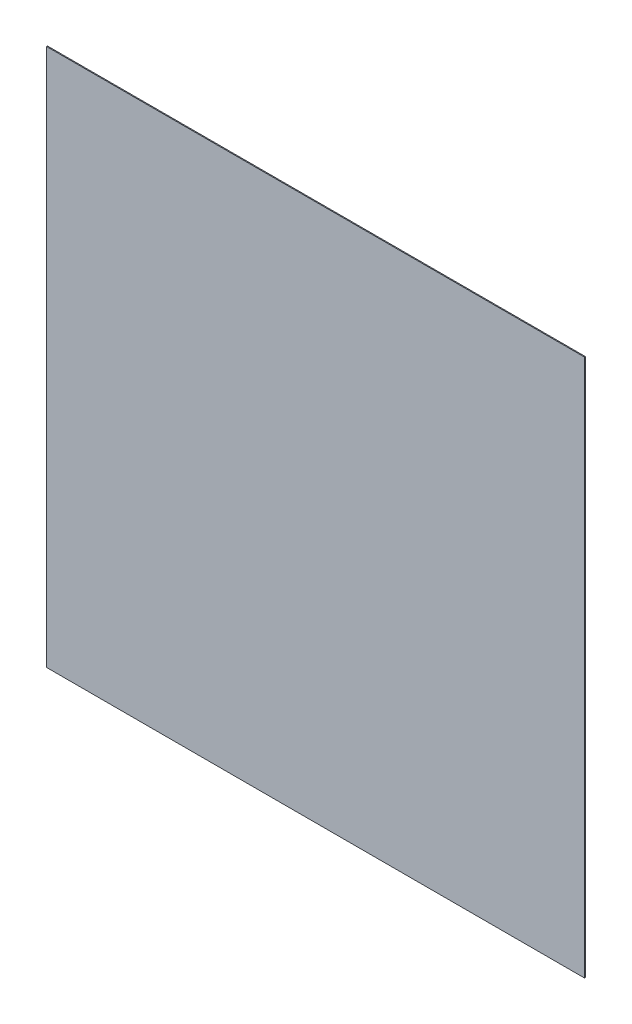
ISO-10303-21;
HEADER;
FILE_DESCRIPTION(('STEP AP214'),'2;1');
FILE_NAME('part.step','',(''),(''),'','','');
FILE_SCHEMA(('AUTOMOTIVE_DESIGN { 1 0 10303 214 1 1 1 1 }'));
ENDSEC;
DATA;
#1=APPLICATION_CONTEXT('core data for automotive mechanical design processes');
#2=APPLICATION_PROTOCOL_DEFINITION('international standard','automotive_design',2000,#1);
#3=PRODUCT_CONTEXT('',#1,'mechanical');
#4=PRODUCT('Part','Part','',(#3));
#5=PRODUCT_RELATED_PRODUCT_CATEGORY('part','',(#4));
#6=PRODUCT_DEFINITION_FORMATION('','',#4);
#7=PRODUCT_DEFINITION_CONTEXT('part definition',#1,'design');
#8=PRODUCT_DEFINITION('design','',#6,#7);
#9=PRODUCT_DEFINITION_SHAPE('','',#8);
#10=(LENGTH_UNIT() NAMED_UNIT(*) SI_UNIT(.MILLI.,.METRE.));
#11=(NAMED_UNIT(*) PLANE_ANGLE_UNIT() SI_UNIT($,.RADIAN.));
#12=(NAMED_UNIT(*) SI_UNIT($,.STERADIAN.) SOLID_ANGLE_UNIT());
#13=UNCERTAINTY_MEASURE_WITH_UNIT(LENGTH_MEASURE(1.E-05),#10,'distance_accuracy_value','');
#14=(GEOMETRIC_REPRESENTATION_CONTEXT(3) GLOBAL_UNCERTAINTY_ASSIGNED_CONTEXT((#13)) GLOBAL_UNIT_ASSIGNED_CONTEXT((#10,
#11,#12)) REPRESENTATION_CONTEXT('',''));
#15=CARTESIAN_POINT('',(0.,0.,0.));
#16=DIRECTION('',(0.,0.,1.));
#17=DIRECTION('',(1.,0.,0.));
#18=AXIS2_PLACEMENT_3D('',#15,#16,#17);
#19=CARTESIAN_POINT('',(-1828.8,1828.8,-6.35));
#20=DIRECTION('',(-1.,0.,0.));
#21=DIRECTION('',(0.,-1.,0.));
#22=AXIS2_PLACEMENT_3D('',#19,#20,#21);
#23=PLANE('',#22);
#24=DIRECTION('',(0.,-1.,0.));
#25=VECTOR('',#24,1.);
#26=CARTESIAN_POINT('',(-1828.8,1828.8,0.));
#27=LINE('',#26,#25);
#28=CARTESIAN_POINT('',(-1828.8,1828.8,0.));
#29=VERTEX_POINT('',#28);
#30=CARTESIAN_POINT('',(-1828.8,-1828.8,0.));
#31=VERTEX_POINT('',#30);
#32=EDGE_CURVE('E71',#29,#31,#27,.T.);
#33=ORIENTED_EDGE('',*,*,#32,.F.);
#34=DIRECTION('',(0.,0.,1.));
#35=VECTOR('',#34,1.);
#36=CARTESIAN_POINT('',(-1828.8,1828.8,-6.35));
#37=LINE('',#36,#35);
#38=CARTESIAN_POINT('',(-1828.8,1828.8,-6.35));
#39=VERTEX_POINT('',#38);
#40=EDGE_CURVE('E11',#39,#29,#37,.T.);
#41=ORIENTED_EDGE('',*,*,#40,.F.);
#42=DIRECTION('',(0.,-1.,0.));
#43=VECTOR('',#42,1.);
#44=CARTESIAN_POINT('',(-1828.8,1828.8,-6.35));
#45=LINE('',#44,#43);
#46=CARTESIAN_POINT('',(-1828.8,-1828.8,-6.35));
#47=VERTEX_POINT('',#46);
#48=EDGE_CURVE('E73',#39,#47,#45,.T.);
#49=ORIENTED_EDGE('',*,*,#48,.T.);
#50=DIRECTION('',(0.,0.,1.));
#51=VECTOR('',#50,1.);
#52=CARTESIAN_POINT('',(-1828.8,-1828.8,-6.35));
#53=LINE('',#52,#51);
#54=EDGE_CURVE('E34',#47,#31,#53,.T.);
#55=ORIENTED_EDGE('',*,*,#54,.T.);
#56=EDGE_LOOP('',(#33,#41,#49,#55));
#57=FACE_BOUND('',#56,.T.);
#58=ADVANCED_FACE('F31',(#57),#23,.T.);
#59=CARTESIAN_POINT('',(-1828.8,1828.8,-6.35));
#60=DIRECTION('',(0.,1.,0.));
#61=DIRECTION('',(0.,0.,1.));
#62=AXIS2_PLACEMENT_3D('',#59,#60,#61);
#63=PLANE('',#62);
#64=DIRECTION('',(-1.,0.,0.));
#65=VECTOR('',#64,1.);
#66=CARTESIAN_POINT('',(-1828.8,1828.8,0.));
#67=LINE('',#66,#65);
#68=CARTESIAN_POINT('',(1828.8,1828.8,0.));
#69=VERTEX_POINT('',#68);
#70=EDGE_CURVE('E88',#69,#29,#67,.T.);
#71=ORIENTED_EDGE('',*,*,#70,.F.);
#72=DIRECTION('',(0.,0.,1.));
#73=VECTOR('',#72,1.);
#74=CARTESIAN_POINT('',(1828.8,1828.8,-6.35));
#75=LINE('',#74,#73);
#76=CARTESIAN_POINT('',(1828.8,1828.8,-6.35));
#77=VERTEX_POINT('',#76);
#78=EDGE_CURVE('E39',#77,#69,#75,.T.);
#79=ORIENTED_EDGE('',*,*,#78,.F.);
#80=DIRECTION('',(-1.,0.,0.));
#81=VECTOR('',#80,1.);
#82=CARTESIAN_POINT('',(-1828.8,1828.8,-6.35));
#83=LINE('',#82,#81);
#84=EDGE_CURVE('E78',#77,#39,#83,.T.);
#85=ORIENTED_EDGE('',*,*,#84,.T.);
#86=ORIENTED_EDGE('',*,*,#40,.T.);
#87=EDGE_LOOP('',(#71,#79,#85,#86));
#88=FACE_BOUND('',#87,.T.);
#89=ADVANCED_FACE('F103',(#88),#63,.T.);
#90=CARTESIAN_POINT('',(1828.8,1828.8,-6.35));
#91=DIRECTION('',(1.,0.,0.));
#92=DIRECTION('',(0.,1.,0.));
#93=AXIS2_PLACEMENT_3D('',#90,#91,#92);
#94=PLANE('',#93);
#95=DIRECTION('',(0.,1.,0.));
#96=VECTOR('',#95,1.);
#97=CARTESIAN_POINT('',(1828.8,1828.8,0.));
#98=LINE('',#97,#96);
#99=CARTESIAN_POINT('',(1828.8,-1828.8,0.));
#100=VERTEX_POINT('',#99);
#101=EDGE_CURVE('E85',#100,#69,#98,.T.);
#102=ORIENTED_EDGE('',*,*,#101,.F.);
#103=DIRECTION('',(0.,0.,1.));
#104=VECTOR('',#103,1.);
#105=CARTESIAN_POINT('',(1828.8,-1828.8,-6.35));
#106=LINE('',#105,#104);
#107=CARTESIAN_POINT('',(1828.8,-1828.8,-6.35));
#108=VERTEX_POINT('',#107);
#109=EDGE_CURVE('E77',#108,#100,#106,.T.);
#110=ORIENTED_EDGE('',*,*,#109,.F.);
#111=DIRECTION('',(0.,1.,0.));
#112=VECTOR('',#111,1.);
#113=CARTESIAN_POINT('',(1828.8,1828.8,-6.35));
#114=LINE('',#113,#112);
#115=EDGE_CURVE('E96',#108,#77,#114,.T.);
#116=ORIENTED_EDGE('',*,*,#115,.T.);
#117=ORIENTED_EDGE('',*,*,#78,.T.);
#118=EDGE_LOOP('',(#102,#110,#116,#117));
#119=FACE_BOUND('',#118,.T.);
#120=ADVANCED_FACE('F100',(#119),#94,.T.);
#121=CARTESIAN_POINT('',(-1828.8,-1828.8,-6.35));
#122=DIRECTION('',(0.,-1.,0.));
#123=DIRECTION('',(0.,0.,-1.));
#124=AXIS2_PLACEMENT_3D('',#121,#122,#123);
#125=PLANE('',#124);
#126=DIRECTION('',(1.,0.,0.));
#127=VECTOR('',#126,1.);
#128=CARTESIAN_POINT('',(-1828.8,-1828.8,0.));
#129=LINE('',#128,#127);
#130=EDGE_CURVE('E80',#31,#100,#129,.T.);
#131=ORIENTED_EDGE('',*,*,#130,.F.);
#132=ORIENTED_EDGE('',*,*,#54,.F.);
#133=DIRECTION('',(1.,0.,0.));
#134=VECTOR('',#133,1.);
#135=CARTESIAN_POINT('',(-1828.8,-1828.8,-6.35));
#136=LINE('',#135,#134);
#137=EDGE_CURVE('E94',#47,#108,#136,.T.);
#138=ORIENTED_EDGE('',*,*,#137,.T.);
#139=ORIENTED_EDGE('',*,*,#109,.T.);
#140=EDGE_LOOP('',(#131,#132,#138,#139));
#141=FACE_BOUND('',#140,.T.);
#142=ADVANCED_FACE('F81',(#141),#125,.T.);
#143=CARTESIAN_POINT('',(-1828.8,-1828.8,-6.35));
#144=DIRECTION('',(0.,0.,1.));
#145=DIRECTION('',(1.,0.,0.));
#146=AXIS2_PLACEMENT_3D('',#143,#144,#145);
#147=PLANE('',#146);
#148=ORIENTED_EDGE('',*,*,#48,.F.);
#149=ORIENTED_EDGE('',*,*,#84,.F.);
#150=ORIENTED_EDGE('',*,*,#115,.F.);
#151=ORIENTED_EDGE('',*,*,#137,.F.);
#152=EDGE_LOOP('',(#148,#149,#150,#151));
#153=FACE_BOUND('',#152,.T.);
#154=ADVANCED_FACE('F105',(#153),#147,.F.);
#155=CARTESIAN_POINT('',(-1828.8,-1828.8,0.));
#156=DIRECTION('',(0.,0.,1.));
#157=DIRECTION('',(1.,0.,0.));
#158=AXIS2_PLACEMENT_3D('',#155,#156,#157);
#159=PLANE('',#158);
#160=ORIENTED_EDGE('',*,*,#32,.T.);
#161=ORIENTED_EDGE('',*,*,#130,.T.);
#162=ORIENTED_EDGE('',*,*,#101,.T.);
#163=ORIENTED_EDGE('',*,*,#70,.T.);
#164=EDGE_LOOP('',(#160,#161,#162,#163));
#165=FACE_BOUND('',#164,.T.);
#166=ADVANCED_FACE('F87',(#165),#159,.T.);
#167=CLOSED_SHELL('',(#58,#89,#120,#142,#154,#166));
#168=MANIFOLD_SOLID_BREP('B2',#167);
#169=ADVANCED_BREP_SHAPE_REPRESENTATION('',(#18,#168),#14);
#170=SHAPE_DEFINITION_REPRESENTATION(#9,#169);
ENDSEC;
END-ISO-10303-21;
